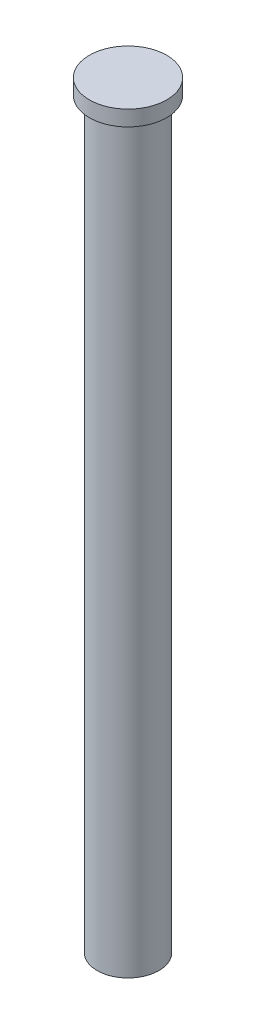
from build123d import *


with BuildPart() as part:
    # Sketch2 → Base-Revolve (revolve)
    with BuildSketch(Plane.XY, mode=Mode.PRIVATE) as base_revolve_sk:
        Polygon((0, 77.7875), (3.96875, 77.7875), (3.96875, 76.2), (3.175, 76.2), (3.175, 0), (0, 0), align=None)
    revolve(base_revolve_sk.sketch.rotate(Axis((0, 0, 0), (0, 1, 0)), 90), axis=Axis((0, 0, 0), (0, 1, 0)))


solid = part.part
